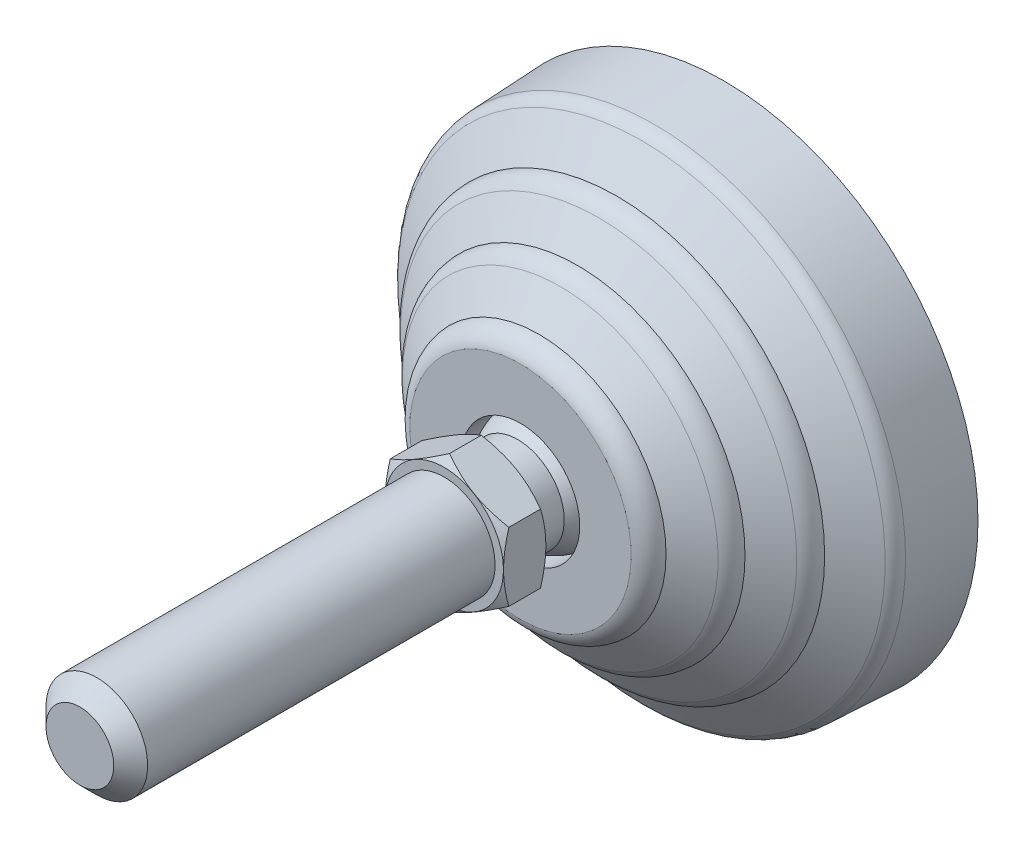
ISO-10303-21;
HEADER;
FILE_DESCRIPTION(('STEP AP214'),'2;1');
FILE_NAME('part.step','',(''),(''),'','','');
FILE_SCHEMA(('AUTOMOTIVE_DESIGN { 1 0 10303 214 1 1 1 1 }'));
ENDSEC;
DATA;
#1=APPLICATION_CONTEXT('core data for automotive mechanical design processes');
#2=APPLICATION_PROTOCOL_DEFINITION('international standard','automotive_design',2000,#1);
#3=PRODUCT_CONTEXT('',#1,'mechanical');
#4=PRODUCT('Part','Part','',(#3));
#5=PRODUCT_RELATED_PRODUCT_CATEGORY('part','',(#4));
#6=PRODUCT_DEFINITION_FORMATION('','',#4);
#7=PRODUCT_DEFINITION_CONTEXT('part definition',#1,'design');
#8=PRODUCT_DEFINITION('design','',#6,#7);
#9=PRODUCT_DEFINITION_SHAPE('','',#8);
#10=(LENGTH_UNIT() NAMED_UNIT(*) SI_UNIT(.MILLI.,.METRE.));
#11=(NAMED_UNIT(*) PLANE_ANGLE_UNIT() SI_UNIT($,.RADIAN.));
#12=(NAMED_UNIT(*) SI_UNIT($,.STERADIAN.) SOLID_ANGLE_UNIT());
#13=UNCERTAINTY_MEASURE_WITH_UNIT(LENGTH_MEASURE(1.E-05),#10,'distance_accuracy_value','');
#14=(GEOMETRIC_REPRESENTATION_CONTEXT(3) GLOBAL_UNCERTAINTY_ASSIGNED_CONTEXT((#13)) GLOBAL_UNIT_ASSIGNED_CONTEXT((#10,
#11,#12)) REPRESENTATION_CONTEXT('',''));
#15=CARTESIAN_POINT('',(0.,0.,0.));
#16=DIRECTION('',(0.,0.,1.));
#17=DIRECTION('',(1.,0.,0.));
#18=AXIS2_PLACEMENT_3D('',#15,#16,#17);
#19=CARTESIAN_POINT('',(0.,0.,53.4265));
#20=DIRECTION('',(0.,0.,-1.));
#21=DIRECTION('',(0.,-1.,0.));
#22=AXIS2_PLACEMENT_3D('',#19,#20,#21);
#23=CYLINDRICAL_SURFACE('',#22,6.);
#24=CARTESIAN_POINT('',(0.,0.,74.));
#25=DIRECTION('',(0.,0.,1.));
#26=DIRECTION('',(0.,-1.,0.));
#27=AXIS2_PLACEMENT_3D('',#24,#25,#26);
#28=CIRCLE('',#27,6.);
#29=CARTESIAN_POINT('',(0.,-6.,74.));
#30=VERTEX_POINT('',#29);
#31=EDGE_CURVE('E9',#30,#30,#28,.F.);
#32=ORIENTED_EDGE('',*,*,#31,.T.);
#33=EDGE_LOOP('',(#32));
#34=FACE_BOUND('',#33,.T.);
#35=CARTESIAN_POINT('',(0.,0.,33.));
#36=DIRECTION('',(0.,0.,-1.));
#37=DIRECTION('',(0.,-1.,0.));
#38=AXIS2_PLACEMENT_3D('',#35,#36,#37);
#39=CIRCLE('',#38,6.);
#40=CARTESIAN_POINT('',(0.,-6.,33.));
#41=VERTEX_POINT('',#40);
#42=EDGE_CURVE('E124',#41,#41,#39,.F.);
#43=ORIENTED_EDGE('',*,*,#42,.T.);
#44=EDGE_LOOP('',(#43));
#45=FACE_BOUND('',#44,.T.);
#46=ADVANCED_FACE('F14',(#34,#45),#23,.T.);
#47=CARTESIAN_POINT('',(-6.495,0.,33.));
#48=DIRECTION('',(0.,0.,1.));
#49=DIRECTION('',(0.,1.,0.));
#50=AXIS2_PLACEMENT_3D('',#47,#48,#49);
#51=PLANE('',#50);
#52=CARTESIAN_POINT('',(0.,0.,33.));
#53=DIRECTION('',(0.,0.,-1.));
#54=DIRECTION('',(0.,-1.,0.));
#55=AXIS2_PLACEMENT_3D('',#52,#53,#54);
#56=CIRCLE('',#55,6.99);
#57=CARTESIAN_POINT('',(0.,-6.99,33.));
#58=VERTEX_POINT('',#57);
#59=EDGE_CURVE('E132',#58,#58,#56,.F.);
#60=ORIENTED_EDGE('',*,*,#59,.T.);
#61=EDGE_LOOP('',(#60));
#62=FACE_BOUND('',#61,.T.);
#63=ORIENTED_EDGE('',*,*,#42,.F.);
#64=EDGE_LOOP('',(#63));
#65=FACE_BOUND('',#64,.T.);
#66=ADVANCED_FACE('F157',(#62,#65),#51,.T.);
#67=CARTESIAN_POINT('',(0.,0.,32.3652257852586));
#68=DIRECTION('',(0.,0.,-1.));
#69=DIRECTION('',(0.,-1.,0.));
#70=AXIS2_PLACEMENT_3D('',#67,#68,#69);
#71=CONICAL_SURFACE('',#70,8.08946119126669,1.0471975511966);
#72=ORIENTED_EDGE('',*,*,#59,.F.);
#73=EDGE_LOOP('',(#72));
#74=FACE_BOUND('',#73,.T.);
#75=CARTESIAN_POINT('',(2.884812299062E-08,8.08290378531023,32.3690117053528));
#76=CARTESIAN_POINT('',(-0.153866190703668,7.99406908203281,32.4202905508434));
#77=CARTESIAN_POINT('',(-0.308306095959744,7.9049031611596,32.4692419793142));
#78=CARTESIAN_POINT('',(-0.618440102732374,7.72584720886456,32.5618490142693));
#79=CARTESIAN_POINT('',(-0.774134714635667,7.63595688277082,32.6055023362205));
#80=CARTESIAN_POINT('',(-1.24371124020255,7.36484674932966,32.7276582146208));
#81=CARTESIAN_POINT('',(-1.55944667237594,7.18255681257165,32.79713799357));
#82=CARTESIAN_POINT('',(-2.03193896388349,6.90976326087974,32.8786092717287));
#83=CARTESIAN_POINT('',(-2.18728420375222,6.8200746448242,32.9018176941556));
#84=CARTESIAN_POINT('',(-2.49867650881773,6.64029221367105,32.9407338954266));
#85=CARTESIAN_POINT('',(-2.65472351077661,6.55019843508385,32.9564423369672));
#86=CARTESIAN_POINT('',(-2.96708844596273,6.36985445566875,32.9799582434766));
#87=CARTESIAN_POINT('',(-3.12340586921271,6.27960454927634,32.9877746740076));
#88=CARTESIAN_POINT('',(-3.43617637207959,6.09902641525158,32.9953473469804));
#89=CARTESIAN_POINT('',(-3.59262944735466,6.00869819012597,32.9951038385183));
#90=CARTESIAN_POINT('',(-4.02123299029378,5.76124381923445,32.9833586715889));
#91=CARTESIAN_POINT('',(-4.29324307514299,5.60419872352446,32.9636515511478));
#92=CARTESIAN_POINT('',(-4.8354566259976,5.29115158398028,32.9011668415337));
#93=CARTESIAN_POINT('',(-5.10565818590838,5.13515064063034,32.8583679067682));
#94=CARTESIAN_POINT('',(-5.64896244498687,4.82147378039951,32.7513856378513));
#95=CARTESIAN_POINT('',(-5.92199660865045,4.66383743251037,32.6867491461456));
#96=CARTESIAN_POINT('',(-6.46399382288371,4.35091519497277,32.5400514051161));
#97=CARTESIAN_POINT('',(-6.73296381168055,4.19562529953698,32.4580246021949));
#98=CARTESIAN_POINT('',(-6.99999992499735,4.04145192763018,32.3690117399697));
#99=B_SPLINE_CURVE_WITH_KNOTS('',3,(#75,#76,#77,#78,#79,#80,#81,#82,#83,#84,#85,#86,#87,#88,#89,
#90,#91,#92,#93,#94,#95,#96,#97,#98),.UNSPECIFIED.,.F.,.F.,(4,2,2,2,2,2,2,2,2,2,2,4),(0.,
0.554720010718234,1.1096783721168,2.22190069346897,2.76439121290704,3.30683378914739,
3.84865943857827,4.39046834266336,5.33360245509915,6.27760987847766,7.24255086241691,
8.20559807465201),.UNSPECIFIED.);
#100=CARTESIAN_POINT('',(1.44240629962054E-08,8.0829037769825,32.3690117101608));
#101=VERTEX_POINT('',#100);
#102=CARTESIAN_POINT('',(-7.,4.04145190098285,32.3690117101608));
#103=VERTEX_POINT('',#102);
#104=EDGE_CURVE('E143',#101,#103,#99,.T.);
#105=ORIENTED_EDGE('',*,*,#104,.T.);
#106=CARTESIAN_POINT('',(-7.,4.04145191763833,32.3690117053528));
#107=CARTESIAN_POINT('',(-7.,3.70968878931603,32.4647934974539));
#108=CARTESIAN_POINT('',(-7.,3.37530112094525,32.5524844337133));
#109=CARTESIAN_POINT('',(-7.,2.70109388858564,32.7074672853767));
#110=CARTESIAN_POINT('',(-7.,2.36126392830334,32.7747135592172));
#111=CARTESIAN_POINT('',(-7.,1.68541720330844,32.882853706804));
#112=CARTESIAN_POINT('',(-7.,1.34949559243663,32.9243241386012));
#113=CARTESIAN_POINT('',(-7.,0.675714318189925,32.9799957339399));
#114=CARTESIAN_POINT('',(-7.,0.3378571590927,32.9942264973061));
#115=CARTESIAN_POINT('',(-7.,-0.337857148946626,32.9942264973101));
#116=CARTESIAN_POINT('',(-7.,-0.675714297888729,32.9799957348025));
#117=CARTESIAN_POINT('',(-7.,-1.34949555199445,32.9243241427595));
#118=CARTESIAN_POINT('',(-7.,-1.68541715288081,32.8828537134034));
#119=CARTESIAN_POINT('',(-7.,-2.36126385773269,32.7747135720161));
#120=CARTESIAN_POINT('',(-7.,-2.70109380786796,32.7074673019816));
#121=CARTESIAN_POINT('',(-7.,-3.37530102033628,32.5524844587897));
#122=CARTESIAN_POINT('',(-7.,-3.70968867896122,32.4647935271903));
#123=CARTESIAN_POINT('',(-7.,-4.04145179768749,32.3690117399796));
#124=B_SPLINE_CURVE_WITH_KNOTS('',3,(#106,#107,#108,#109,#110,#111,#112,#113,#114,#115,#116,
#117,#118,#119,#120,#121,#122,#123),.UNSPECIFIED.,.F.,.F.,(4,2,2,2,2,2,2,2,4),(0.,
1.03625689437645,2.07481046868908,3.08920803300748,4.10250268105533,5.11579729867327,
6.13019483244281,7.16874837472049,8.20500523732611),.UNSPECIFIED.);
#125=CARTESIAN_POINT('',(-7.00000001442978,-4.04145187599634,32.3690117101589));
#126=VERTEX_POINT('',#125);
#127=EDGE_CURVE('E135',#103,#126,#124,.T.);
#128=ORIENTED_EDGE('',*,*,#127,.T.);
#129=CARTESIAN_POINT('',(-7.00000002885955,-4.04145186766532,32.3690117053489));
#130=CARTESIAN_POINT('',(-6.84613380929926,-4.13028657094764,32.4202905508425));
#131=CARTESIAN_POINT('',(-6.69169390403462,-4.2194524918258,32.4692419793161));
#132=CARTESIAN_POINT('',(-6.3815598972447,-4.39850844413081,32.5618490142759));
#133=CARTESIAN_POINT('',(-6.2258652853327,-4.48839877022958,32.6055023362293));
#134=CARTESIAN_POINT('',(-5.75628875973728,-4.75950890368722,32.7276582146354));
#135=CARTESIAN_POINT('',(-5.44055332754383,-4.94179884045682,32.797137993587));
#136=CARTESIAN_POINT('',(-4.96806103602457,-5.21459239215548,32.8786092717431));
#137=CARTESIAN_POINT('',(-4.81271579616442,-5.30428100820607,32.9018176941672));
#138=CARTESIAN_POINT('',(-4.50132349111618,-5.48406343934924,32.9407338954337));
#139=CARTESIAN_POINT('',(-4.345276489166,-5.57415721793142,32.9564423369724));
#140=CARTESIAN_POINT('',(-4.0329115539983,-5.75450119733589,32.9799582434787));
#141=CARTESIAN_POINT('',(-3.87659413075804,-5.84475110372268,32.9877746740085));
#142=CARTESIAN_POINT('',(-3.56382362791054,-6.02532923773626,32.9953473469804));
#143=CARTESIAN_POINT('',(-3.40737055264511,-6.1156574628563,32.9951038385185));
#144=CARTESIAN_POINT('',(-2.97876700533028,-6.36311183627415,32.9833586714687));
#145=CARTESIAN_POINT('',(-2.70675691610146,-6.5201569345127,32.9636515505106));
#146=CARTESIAN_POINT('',(-2.16454335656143,-6.8332040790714,32.9011668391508));
#147=CARTESIAN_POINT('',(-1.89434179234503,-6.9892050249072,32.8583679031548));
#148=CARTESIAN_POINT('',(-1.35103752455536,-7.30288189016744,32.7513856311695));
#149=CARTESIAN_POINT('',(-1.07800335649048,-7.46051824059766,32.6867491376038));
#150=CARTESIAN_POINT('',(-0.536006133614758,-7.77344048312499,32.5400513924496));
#151=CARTESIAN_POINT('',(-0.267036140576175,-7.92873038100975,32.4580245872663));
#152=CARTESIAN_POINT('',(-2.30772582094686E-08,-8.0829037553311,32.3690117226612));
#153=B_SPLINE_CURVE_WITH_KNOTS('',3,(#129,#130,#131,#132,#133,#134,#135,#136,#137,#138,#139,
#140,#141,#142,#143,#144,#145,#146,#147,#148,#149,#150,#151,#152),.UNSPECIFIED.,.F.,.F.,(4,2,2,
2,2,2,2,2,2,2,2,4),(0.,0.554720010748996,1.10967837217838,2.22190069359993,2.7643912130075,
3.30683378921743,3.84865943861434,4.3904683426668,5.33360247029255,6.2776099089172,
7.24255090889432,8.20559813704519),.UNSPECIFIED.);
#154=CARTESIAN_POINT('',(1.15386261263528E-08,-8.08290376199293,32.369011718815));
#155=VERTEX_POINT('',#154);
#156=EDGE_CURVE('E181',#126,#155,#153,.T.);
#157=ORIENTED_EDGE('',*,*,#156,.T.);
#158=CARTESIAN_POINT('',(2.30772558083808E-08,-8.0829037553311,32.3690117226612));
#159=CARTESIAN_POINT('',(0.153866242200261,-7.99406905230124,32.4202905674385));
#160=CARTESIAN_POINT('',(0.308306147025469,-7.90490313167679,32.4692419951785));
#161=CARTESIAN_POINT('',(0.618440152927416,-7.72584717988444,32.5618490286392));
#162=CARTESIAN_POINT('',(0.77413476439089,-7.63595685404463,32.6055023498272));
#163=CARTESIAN_POINT('',(1.24371128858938,-7.3648467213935,32.7276582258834));
#164=CARTESIAN_POINT('',(1.55944671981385,-7.18255678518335,32.7971380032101));
#165=CARTESIAN_POINT('',(2.03193900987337,-6.90976323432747,32.878609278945));
#166=CARTESIAN_POINT('',(2.18728424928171,-6.82007461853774,32.9018177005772));
#167=CARTESIAN_POINT('',(2.49867655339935,-6.64029218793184,32.9407339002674));
#168=CARTESIAN_POINT('',(2.65472355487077,-6.55019840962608,32.9564423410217));
#169=CARTESIAN_POINT('',(2.96708848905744,-6.369854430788,32.9799582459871));
#170=CARTESIAN_POINT('',(3.12340591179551,-6.27960452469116,32.98777467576));
#171=CARTESIAN_POINT('',(3.43617641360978,-6.09902639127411,32.9953473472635));
#172=CARTESIAN_POINT('',(3.59262948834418,-6.00869816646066,32.99510383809));
#173=CARTESIAN_POINT('',(4.02123302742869,-5.76124379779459,32.9833586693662));
#174=CARTESIAN_POINT('',(4.29324310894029,-5.60419870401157,32.9636515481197));
#175=CARTESIAN_POINT('',(4.83545665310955,-5.2911515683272,32.9011668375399));
#176=CARTESIAN_POINT('',(5.10565820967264,-5.13515062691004,32.8583679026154));
#177=CARTESIAN_POINT('',(5.64896246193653,-4.82147377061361,32.7513856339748));
#178=CARTESIAN_POINT('',(5.92199662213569,-4.66383742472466,32.6867491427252));
#179=CARTESIAN_POINT('',(6.46399382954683,-4.35091519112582,32.5400514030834));
#180=CARTESIAN_POINT('',(6.73296381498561,-4.19562529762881,32.4580246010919));
#181=CARTESIAN_POINT('',(6.99999992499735,-4.04145192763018,32.3690117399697));
#182=B_SPLINE_CURVE_WITH_KNOTS('',3,(#158,#159,#160,#161,#162,#163,#164,#165,#166,#167,#168,
#169,#170,#171,#172,#173,#174,#175,#176,#177,#178,#179,#180,#181),.UNSPECIFIED.,.F.,.F.,(4,2,2,
2,2,2,2,2,2,2,2,4),(0.,0.554720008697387,1.10967836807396,2.22190068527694,2.76439120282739,
3.30683377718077,3.8486594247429,4.39046832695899,5.33360242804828,6.27760984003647,
7.24255081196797,8.20559801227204),.UNSPECIFIED.);
#183=CARTESIAN_POINT('',(7.,-4.04145190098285,32.3690117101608));
#184=VERTEX_POINT('',#183);
#185=EDGE_CURVE('E173',#155,#184,#182,.T.);
#186=ORIENTED_EDGE('',*,*,#185,.T.);
#187=CARTESIAN_POINT('',(7.,-4.04145191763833,32.3690117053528));
#188=CARTESIAN_POINT('',(7.,-3.70968878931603,32.4647934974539));
#189=CARTESIAN_POINT('',(7.,-3.37530112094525,32.5524844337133));
#190=CARTESIAN_POINT('',(7.,-2.70109388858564,32.7074672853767));
#191=CARTESIAN_POINT('',(7.,-2.36126392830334,32.7747135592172));
#192=CARTESIAN_POINT('',(7.,-1.68541720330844,32.882853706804));
#193=CARTESIAN_POINT('',(7.,-1.34949559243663,32.9243241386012));
#194=CARTESIAN_POINT('',(7.,-0.675714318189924,32.9799957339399));
#195=CARTESIAN_POINT('',(7.,-0.3378571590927,32.9942264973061));
#196=CARTESIAN_POINT('',(7.,0.337857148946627,32.9942264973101));
#197=CARTESIAN_POINT('',(7.,0.675714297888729,32.9799957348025));
#198=CARTESIAN_POINT('',(7.,1.34949555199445,32.9243241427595));
#199=CARTESIAN_POINT('',(7.,1.68541715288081,32.8828537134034));
#200=CARTESIAN_POINT('',(7.,2.36126385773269,32.7747135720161));
#201=CARTESIAN_POINT('',(7.,2.70109380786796,32.7074673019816));
#202=CARTESIAN_POINT('',(7.,3.37530102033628,32.5524844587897));
#203=CARTESIAN_POINT('',(7.,3.70968867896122,32.4647935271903));
#204=CARTESIAN_POINT('',(7.,4.04145179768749,32.3690117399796));
#205=B_SPLINE_CURVE_WITH_KNOTS('',3,(#187,#188,#189,#190,#191,#192,#193,#194,#195,#196,#197,
#198,#199,#200,#201,#202,#203,#204),.UNSPECIFIED.,.F.,.F.,(4,2,2,2,2,2,2,2,4),(0.,
1.03625689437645,2.07481046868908,3.08920803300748,4.10250268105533,5.11579729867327,
6.13019483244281,7.16874837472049,8.20500523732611),.UNSPECIFIED.);
#206=CARTESIAN_POINT('',(7.00000001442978,4.04145187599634,32.3690117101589));
#207=VERTEX_POINT('',#206);
#208=EDGE_CURVE('E342',#184,#207,#205,.T.);
#209=ORIENTED_EDGE('',*,*,#208,.T.);
#210=CARTESIAN_POINT('',(7.00000002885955,4.04145186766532,32.3690117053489));
#211=CARTESIAN_POINT('',(6.84613380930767,4.13028657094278,32.4202905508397));
#212=CARTESIAN_POINT('',(6.6916939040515,4.21945249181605,32.4692419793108));
#213=CARTESIAN_POINT('',(6.38155989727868,4.39850844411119,32.5618490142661));
#214=CARTESIAN_POINT('',(6.22586528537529,4.48839877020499,32.6055023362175));
#215=CARTESIAN_POINT('',(5.7562887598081,4.75950890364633,32.7276582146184));
#216=CARTESIAN_POINT('',(5.4405533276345,4.94179884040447,32.7971379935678));
#217=CARTESIAN_POINT('',(4.96806103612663,5.21459239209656,32.8786092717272));
#218=CARTESIAN_POINT('',(4.81271579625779,5.30428100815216,32.9018176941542));
#219=CARTESIAN_POINT('',(4.50132349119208,5.48406343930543,32.9407338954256));
#220=CARTESIAN_POINT('',(4.34527648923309,5.57415721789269,32.9564423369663));
#221=CARTESIAN_POINT('',(4.03291155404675,5.75450119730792,32.9799582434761));
#222=CARTESIAN_POINT('',(3.87659413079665,5.84475110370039,32.9877746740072));
#223=CARTESIAN_POINT('',(3.56382362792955,6.02532923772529,32.9953473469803));
#224=CARTESIAN_POINT('',(3.40737055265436,6.11565746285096,32.9951038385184));
#225=CARTESIAN_POINT('',(2.97876700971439,6.36311183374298,32.9833586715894));
#226=CARTESIAN_POINT('',(2.70675692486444,6.52015692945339,32.9636515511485));
#227=CARTESIAN_POINT('',(2.16454337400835,6.83320406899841,32.9011668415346));
#228=CARTESIAN_POINT('',(1.89434181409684,6.98920501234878,32.8583679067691));
#229=CARTESIAN_POINT('',(1.35103755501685,7.30288187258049,32.7513856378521));
#230=CARTESIAN_POINT('',(1.07800339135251,7.46051822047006,32.6867491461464));
#231=CARTESIAN_POINT('',(0.536006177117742,7.77344045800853,32.5400514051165));
#232=CARTESIAN_POINT('',(0.267036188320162,7.92873035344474,32.4580246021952));
#233=CARTESIAN_POINT('',(7.50026377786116E-08,8.08290372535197,32.3690117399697));
#234=B_SPLINE_CURVE_WITH_KNOTS('',3,(#210,#211,#212,#213,#214,#215,#216,#217,#218,#219,#220,
#221,#222,#223,#224,#225,#226,#227,#228,#229,#230,#231,#232,#233),.UNSPECIFIED.,.F.,.F.,(4,2,2,
2,2,2,2,2,2,2,2,4),(0.,0.554720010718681,1.1096783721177,2.22190069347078,2.76439121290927,
3.30683378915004,3.84865943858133,4.39046834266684,5.33360245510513,6.27760987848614,
7.24255086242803,8.20559807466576),.UNSPECIFIED.);
#235=EDGE_CURVE('E163',#207,#101,#234,.T.);
#236=ORIENTED_EDGE('',*,*,#235,.T.);
#237=EDGE_LOOP('',(#105,#128,#157,#186,#209,#236));
#238=FACE_BOUND('',#237,.T.);
#239=ADVANCED_FACE('F152',(#74,#238),#71,.T.);
#240=CARTESIAN_POINT('',(0.,8.08290376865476,33.1));
#241=DIRECTION('',(-0.5,-0.866025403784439,0.));
#242=DIRECTION('',(0.866025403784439,-0.5,0.));
#243=AXIS2_PLACEMENT_3D('',#240,#241,#242);
#244=PLANE('',#243);
#245=DIRECTION('',(0.,0.,1.));
#246=VECTOR('',#245,1.);
#247=CARTESIAN_POINT('',(0.,8.08290376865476,33.1));
#248=LINE('',#247,#246);
#249=CARTESIAN_POINT('',(0.,8.08290376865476,28.6309882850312));
#250=VERTEX_POINT('',#249);
#251=EDGE_CURVE('E368',#250,#101,#248,.T.);
#252=ORIENTED_EDGE('',*,*,#251,.T.);
#253=ORIENTED_EDGE('',*,*,#235,.F.);
#254=DIRECTION('',(0.,0.,1.));
#255=VECTOR('',#254,1.);
#256=CARTESIAN_POINT('',(7.,4.04145188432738,33.1));
#257=LINE('',#256,#255);
#258=CARTESIAN_POINT('',(7.,4.04145188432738,28.6309882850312));
#259=VERTEX_POINT('',#258);
#260=EDGE_CURVE('E360',#259,#207,#257,.T.);
#261=ORIENTED_EDGE('',*,*,#260,.F.);
#262=CARTESIAN_POINT('',(0.,8.08290376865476,28.6309882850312));
#263=CARTESIAN_POINT('',(0.153866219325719,7.99406906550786,28.5797094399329));
#264=CARTESIAN_POINT('',(0.308306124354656,7.90490314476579,28.5307580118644));
#265=CARTESIAN_POINT('',(0.618440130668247,7.72584719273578,28.4381509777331));
#266=CARTESIAN_POINT('',(0.774134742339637,7.63595686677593,28.3944976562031));
#267=CARTESIAN_POINT('',(1.24371126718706,7.36484673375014,28.2723417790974));
#268=CARTESIAN_POINT('',(1.55944669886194,7.18255679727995,28.2028620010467));
#269=CARTESIAN_POINT('',(2.03193898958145,6.90976324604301,28.1213907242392));
#270=CARTESIAN_POINT('',(2.18728422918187,6.82007463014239,28.098182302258));
#271=CARTESIAN_POINT('',(2.49867653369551,6.64029219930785,28.0592661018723));
#272=CARTESIAN_POINT('',(2.65472353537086,6.55019842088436,28.0435576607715));
#273=CARTESIAN_POINT('',(2.96708846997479,6.36985444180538,28.0200417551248));
#274=CARTESIAN_POINT('',(3.12340589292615,6.27960453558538,28.012225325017));
#275=CARTESIAN_POINT('',(3.43617639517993,6.09902640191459,28.0046526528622));
#276=CARTESIAN_POINT('',(3.59262947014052,6.00869817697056,28.0048961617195));
#277=CARTESIAN_POINT('',(4.02123301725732,5.76124380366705,28.0166413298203));
#278=CARTESIAN_POINT('',(4.29324310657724,5.60419870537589,28.0363484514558));
#279=CARTESIAN_POINT('',(4.83545666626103,5.29115156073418,28.0988331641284));
#280=CARTESIAN_POINT('',(5.10565823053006,5.135150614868,28.1416321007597));
#281=CARTESIAN_POINT('',(5.64896249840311,4.82147374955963,28.248614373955));
#282=CARTESIAN_POINT('',(5.92199666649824,4.66383739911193,28.3132508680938));
#283=CARTESIAN_POINT('',(6.46399388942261,4.35091515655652,28.4599486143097));
#284=CARTESIAN_POINT('',(6.73296388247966,4.1956252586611,28.5419754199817));
#285=CARTESIAN_POINT('',(7.,4.04145188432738,28.6309882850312));
#286=B_SPLINE_CURVE_WITH_KNOTS('',3,(#262,#263,#264,#265,#266,#267,#268,#269,#270,#271,#272,
#273,#274,#275,#276,#277,#278,#279,#280,#281,#282,#283,#284,#285),.UNSPECIFIED.,.F.,.F.,(4,2,2,
2,2,2,2,2,2,2,2,4),(0.,0.5547200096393,1.10967836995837,2.22190068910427,2.76439120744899,
3.30683378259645,3.84865943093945,4.39046833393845,5.33360246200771,6.2776099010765,
7.24255090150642,8.20559813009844),.UNSPECIFIED.);
#287=EDGE_CURVE('E362',#250,#259,#286,.T.);
#288=ORIENTED_EDGE('',*,*,#287,.F.);
#289=EDGE_LOOP('',(#252,#253,#261,#288));
#290=FACE_BOUND('',#289,.T.);
#291=ADVANCED_FACE('F156',(#290),#244,.F.);
#292=CARTESIAN_POINT('',(-7.,4.04145188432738,33.1));
#293=DIRECTION('',(0.5,-0.866025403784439,0.));
#294=DIRECTION('',(0.866025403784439,0.5,0.));
#295=AXIS2_PLACEMENT_3D('',#292,#293,#294);
#296=PLANE('',#295);
#297=DIRECTION('',(0.,0.,1.));
#298=VECTOR('',#297,1.);
#299=CARTESIAN_POINT('',(-7.,4.04145188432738,33.1));
#300=LINE('',#299,#298);
#301=CARTESIAN_POINT('',(-7.,4.04145188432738,28.6309882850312));
#302=VERTEX_POINT('',#301);
#303=EDGE_CURVE('E31',#302,#103,#300,.T.);
#304=ORIENTED_EDGE('',*,*,#303,.T.);
#305=ORIENTED_EDGE('',*,*,#104,.F.);
#306=ORIENTED_EDGE('',*,*,#251,.F.);
#307=CARTESIAN_POINT('',(-7.,4.04145188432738,28.6309882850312));
#308=CARTESIAN_POINT('',(-6.84613378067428,4.13028658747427,28.5797094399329));
#309=CARTESIAN_POINT('',(-6.69169387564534,4.21945250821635,28.5307580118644));
#310=CARTESIAN_POINT('',(-6.38155986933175,4.39850846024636,28.4381509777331));
#311=CARTESIAN_POINT('',(-6.22586525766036,4.48839878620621,28.3944976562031));
#312=CARTESIAN_POINT('',(-5.75628873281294,4.759508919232,28.2723417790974));
#313=CARTESIAN_POINT('',(-5.44055330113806,4.94179885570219,28.2028620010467));
#314=CARTESIAN_POINT('',(-4.96806101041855,5.21459240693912,28.1213907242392));
#315=CARTESIAN_POINT('',(-4.81271577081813,5.30428102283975,28.098182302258));
#316=CARTESIAN_POINT('',(-4.50132346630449,5.48406345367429,28.0592661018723));
#317=CARTESIAN_POINT('',(-4.34527646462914,5.57415723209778,28.0435576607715));
#318=CARTESIAN_POINT('',(-4.0329115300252,5.75450121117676,28.0200417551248));
#319=CARTESIAN_POINT('',(-3.87659410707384,5.84475111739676,28.012225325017));
#320=CARTESIAN_POINT('',(-3.56382360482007,6.02532925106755,28.0046526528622));
#321=CARTESIAN_POINT('',(-3.40737052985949,6.11565747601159,28.0048961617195));
#322=CARTESIAN_POINT('',(-2.97876698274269,6.36311184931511,28.0166413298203));
#323=CARTESIAN_POINT('',(-2.70675689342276,6.52015694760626,28.0363484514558));
#324=CARTESIAN_POINT('',(-2.16454333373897,6.83320409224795,28.0988331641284));
#325=CARTESIAN_POINT('',(-1.89434176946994,6.98920503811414,28.1416321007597));
#326=CARTESIAN_POINT('',(-1.35103750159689,7.30288190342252,28.248614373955));
#327=CARTESIAN_POINT('',(-1.07800333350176,7.4605182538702,28.3132508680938));
#328=CARTESIAN_POINT('',(-0.536006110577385,7.77344049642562,28.4599486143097));
#329=CARTESIAN_POINT('',(-0.267036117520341,7.92873039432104,28.5419754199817));
#330=CARTESIAN_POINT('',(0.,8.08290376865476,28.6309882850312));
#331=B_SPLINE_CURVE_WITH_KNOTS('',3,(#307,#308,#309,#310,#311,#312,#313,#314,#315,#316,#317,
#318,#319,#320,#321,#322,#323,#324,#325,#326,#327,#328,#329,#330),.UNSPECIFIED.,.F.,.F.,(4,2,2,
2,2,2,2,2,2,2,2,4),(0.,0.5547200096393,1.10967836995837,2.22190068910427,2.76439120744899,
3.30683378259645,3.84865943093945,4.39046833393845,5.33360246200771,6.2776099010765,
7.24255090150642,8.20559813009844),.UNSPECIFIED.);
#332=EDGE_CURVE('E369',#302,#250,#331,.T.);
#333=ORIENTED_EDGE('',*,*,#332,.F.);
#334=EDGE_LOOP('',(#304,#305,#306,#333));
#335=FACE_BOUND('',#334,.T.);
#336=ADVANCED_FACE('F375',(#335),#296,.F.);
#337=CARTESIAN_POINT('',(7.,-4.04145188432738,33.1));
#338=DIRECTION('',(-0.5,0.866025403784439,0.));
#339=DIRECTION('',(-0.866025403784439,-0.5,0.));
#340=AXIS2_PLACEMENT_3D('',#337,#338,#339);
#341=PLANE('',#340);
#342=DIRECTION('',(0.,0.,1.));
#343=VECTOR('',#342,1.);
#344=CARTESIAN_POINT('',(7.,-4.04145188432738,33.1));
#345=LINE('',#344,#343);
#346=CARTESIAN_POINT('',(7.,-4.04145188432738,28.6309882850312));
#347=VERTEX_POINT('',#346);
#348=EDGE_CURVE('E361',#347,#184,#345,.T.);
#349=ORIENTED_EDGE('',*,*,#348,.T.);
#350=ORIENTED_EDGE('',*,*,#185,.F.);
#351=DIRECTION('',(0.,0.,1.));
#352=VECTOR('',#351,1.);
#353=CARTESIAN_POINT('',(0.,-8.08290376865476,33.1));
#354=LINE('',#353,#352);
#355=CARTESIAN_POINT('',(0.,-8.08290376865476,28.6309882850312));
#356=VERTEX_POINT('',#355);
#357=EDGE_CURVE('E212',#356,#155,#354,.T.);
#358=ORIENTED_EDGE('',*,*,#357,.F.);
#359=CARTESIAN_POINT('',(7.,-4.04145188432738,28.6309882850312));
#360=CARTESIAN_POINT('',(6.84613378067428,-4.13028658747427,28.5797094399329));
#361=CARTESIAN_POINT('',(6.69169387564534,-4.21945250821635,28.5307580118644));
#362=CARTESIAN_POINT('',(6.38155986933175,-4.39850846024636,28.4381509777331));
#363=CARTESIAN_POINT('',(6.22586525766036,-4.48839878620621,28.3944976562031));
#364=CARTESIAN_POINT('',(5.75628873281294,-4.759508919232,28.2723417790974));
#365=CARTESIAN_POINT('',(5.44055330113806,-4.94179885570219,28.2028620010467));
#366=CARTESIAN_POINT('',(4.96806101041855,-5.21459240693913,28.1213907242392));
#367=CARTESIAN_POINT('',(4.81271577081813,-5.30428102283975,28.098182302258));
#368=CARTESIAN_POINT('',(4.50132346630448,-5.48406345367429,28.0592661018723));
#369=CARTESIAN_POINT('',(4.34527646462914,-5.57415723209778,28.0435576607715));
#370=CARTESIAN_POINT('',(4.0329115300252,-5.75450121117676,28.0200417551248));
#371=CARTESIAN_POINT('',(3.87659410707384,-5.84475111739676,28.0122253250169));
#372=CARTESIAN_POINT('',(3.56382360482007,-6.02532925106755,28.0046526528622));
#373=CARTESIAN_POINT('',(3.40737052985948,-6.11565747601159,28.0048961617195));
#374=CARTESIAN_POINT('',(2.97876698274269,-6.36311184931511,28.0166413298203));
#375=CARTESIAN_POINT('',(2.70675689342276,-6.52015694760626,28.0363484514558));
#376=CARTESIAN_POINT('',(2.16454333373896,-6.83320409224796,28.0988331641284));
#377=CARTESIAN_POINT('',(1.89434176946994,-6.98920503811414,28.1416321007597));
#378=CARTESIAN_POINT('',(1.35103750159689,-7.30288190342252,28.248614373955));
#379=CARTESIAN_POINT('',(1.07800333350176,-7.46051825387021,28.3132508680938));
#380=CARTESIAN_POINT('',(0.536006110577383,-7.77344049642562,28.4599486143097));
#381=CARTESIAN_POINT('',(0.267036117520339,-7.92873039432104,28.5419754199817));
#382=CARTESIAN_POINT('',(0.,-8.08290376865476,28.6309882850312));
#383=B_SPLINE_CURVE_WITH_KNOTS('',3,(#359,#360,#361,#362,#363,#364,#365,#366,#367,#368,#369,
#370,#371,#372,#373,#374,#375,#376,#377,#378,#379,#380,#381,#382),.UNSPECIFIED.,.F.,.F.,(4,2,2,
2,2,2,2,2,2,2,2,4),(0.,0.554720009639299,1.10967836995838,2.22190068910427,2.76439120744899,
3.30683378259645,3.84865943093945,4.39046833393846,5.33360246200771,6.27760990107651,
7.24255090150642,8.20559813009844),.UNSPECIFIED.);
#384=EDGE_CURVE('E214',#347,#356,#383,.T.);
#385=ORIENTED_EDGE('',*,*,#384,.F.);
#386=EDGE_LOOP('',(#349,#350,#358,#385));
#387=FACE_BOUND('',#386,.T.);
#388=ADVANCED_FACE('F200',(#387),#341,.F.);
#389=CARTESIAN_POINT('',(7.,4.04145188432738,33.1));
#390=DIRECTION('',(-1.,0.,0.));
#391=DIRECTION('',(0.,-1.,0.));
#392=AXIS2_PLACEMENT_3D('',#389,#390,#391);
#393=PLANE('',#392);
#394=ORIENTED_EDGE('',*,*,#260,.T.);
#395=ORIENTED_EDGE('',*,*,#208,.F.);
#396=ORIENTED_EDGE('',*,*,#348,.F.);
#397=CARTESIAN_POINT('',(7.,4.04145188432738,28.6309882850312));
#398=CARTESIAN_POINT('',(7.,3.70968875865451,28.5352064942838));
#399=CARTESIAN_POINT('',(7.,3.3753010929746,28.4475155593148));
#400=CARTESIAN_POINT('',(7.,2.7010938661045,28.292532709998));
#401=CARTESIAN_POINT('',(7.,2.36126390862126,28.2252864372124));
#402=CARTESIAN_POINT('',(7.,1.68541718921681,28.1171462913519));
#403=CARTESIAN_POINT('',(7.,1.3494955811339,28.075675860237));
#404=CARTESIAN_POINT('',(7.,0.675714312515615,28.0200042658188));
#405=CARTESIAN_POINT('',(7.,0.337857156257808,28.0057735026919));
#406=CARTESIAN_POINT('',(7.,-0.337857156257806,28.0057735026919));
#407=CARTESIAN_POINT('',(7.,-0.675714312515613,28.0200042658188));
#408=CARTESIAN_POINT('',(7.,-1.3494955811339,28.075675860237));
#409=CARTESIAN_POINT('',(7.,-1.68541718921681,28.1171462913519));
#410=CARTESIAN_POINT('',(7.,-2.36126390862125,28.2252864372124));
#411=CARTESIAN_POINT('',(7.,-2.7010938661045,28.292532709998));
#412=CARTESIAN_POINT('',(7.,-3.3753010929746,28.4475155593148));
#413=CARTESIAN_POINT('',(7.,-3.70968875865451,28.5352064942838));
#414=CARTESIAN_POINT('',(7.,-4.04145188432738,28.6309882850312));
#415=B_SPLINE_CURVE_WITH_KNOTS('',3,(#397,#398,#399,#400,#401,#402,#403,#404,#405,#406,#407,
#408,#409,#410,#411,#412,#413,#414),.UNSPECIFIED.,.F.,.F.,(4,2,2,2,2,2,2,2,4),(0.,
1.03625688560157,2.07481045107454,3.08920800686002,4.10250264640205,5.11579728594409,
6.13019484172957,7.16874840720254,8.20500529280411),.UNSPECIFIED.);
#416=EDGE_CURVE('E354',#259,#347,#415,.T.);
#417=ORIENTED_EDGE('',*,*,#416,.F.);
#418=EDGE_LOOP('',(#394,#395,#396,#417));
#419=FACE_BOUND('',#418,.T.);
#420=ADVANCED_FACE('F348',(#419),#393,.F.);
#421=CARTESIAN_POINT('',(-7.,-4.04145188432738,33.1));
#422=DIRECTION('',(1.,0.,0.));
#423=DIRECTION('',(0.,1.,0.));
#424=AXIS2_PLACEMENT_3D('',#421,#422,#423);
#425=PLANE('',#424);
#426=DIRECTION('',(0.,0.,1.));
#427=VECTOR('',#426,1.);
#428=CARTESIAN_POINT('',(-7.,-4.04145188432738,33.1));
#429=LINE('',#428,#427);
#430=CARTESIAN_POINT('',(-7.,-4.04145188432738,28.6309882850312));
#431=VERTEX_POINT('',#430);
#432=EDGE_CURVE('E402',#126,#431,#429,.F.);
#433=ORIENTED_EDGE('',*,*,#432,.F.);
#434=ORIENTED_EDGE('',*,*,#127,.F.);
#435=ORIENTED_EDGE('',*,*,#303,.F.);
#436=CARTESIAN_POINT('',(-7.,-4.04145188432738,28.6309882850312));
#437=CARTESIAN_POINT('',(-7.,-3.70968875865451,28.5352064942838));
#438=CARTESIAN_POINT('',(-7.,-3.3753010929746,28.4475155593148));
#439=CARTESIAN_POINT('',(-7.,-2.7010938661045,28.292532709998));
#440=CARTESIAN_POINT('',(-7.,-2.36126390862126,28.2252864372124));
#441=CARTESIAN_POINT('',(-7.,-1.68541718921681,28.1171462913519));
#442=CARTESIAN_POINT('',(-7.,-1.3494955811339,28.075675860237));
#443=CARTESIAN_POINT('',(-7.,-0.675714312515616,28.0200042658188));
#444=CARTESIAN_POINT('',(-7.,-0.33785715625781,28.0057735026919));
#445=CARTESIAN_POINT('',(-7.,0.337857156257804,28.0057735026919));
#446=CARTESIAN_POINT('',(-7.,0.675714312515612,28.0200042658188));
#447=CARTESIAN_POINT('',(-7.,1.3494955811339,28.075675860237));
#448=CARTESIAN_POINT('',(-7.,1.68541718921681,28.1171462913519));
#449=CARTESIAN_POINT('',(-7.,2.36126390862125,28.2252864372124));
#450=CARTESIAN_POINT('',(-7.,2.7010938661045,28.292532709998));
#451=CARTESIAN_POINT('',(-7.,3.3753010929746,28.4475155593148));
#452=CARTESIAN_POINT('',(-7.,3.70968875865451,28.5352064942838));
#453=CARTESIAN_POINT('',(-7.,4.04145188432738,28.6309882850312));
#454=B_SPLINE_CURVE_WITH_KNOTS('',3,(#436,#437,#438,#439,#440,#441,#442,#443,#444,#445,#446,
#447,#448,#449,#450,#451,#452,#453),.UNSPECIFIED.,.F.,.F.,(4,2,2,2,2,2,2,2,4),(0.,
1.03625688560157,2.07481045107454,3.08920800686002,4.10250264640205,5.11579728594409,
6.13019484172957,7.16874840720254,8.20500529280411),.UNSPECIFIED.);
#455=EDGE_CURVE('E189',#431,#302,#454,.T.);
#456=ORIENTED_EDGE('',*,*,#455,.F.);
#457=EDGE_LOOP('',(#433,#434,#435,#456));
#458=FACE_BOUND('',#457,.T.);
#459=ADVANCED_FACE('F150',(#458),#425,.F.);
#460=CARTESIAN_POINT('',(0.,-8.08290376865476,33.1));
#461=DIRECTION('',(0.5,0.866025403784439,0.));
#462=DIRECTION('',(-0.866025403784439,0.5,0.));
#463=AXIS2_PLACEMENT_3D('',#460,#461,#462);
#464=PLANE('',#463);
#465=ORIENTED_EDGE('',*,*,#357,.T.);
#466=ORIENTED_EDGE('',*,*,#156,.F.);
#467=ORIENTED_EDGE('',*,*,#432,.T.);
#468=CARTESIAN_POINT('',(0.,-8.08290376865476,28.6309882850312));
#469=CARTESIAN_POINT('',(-0.153866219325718,-7.99406906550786,28.5797094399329));
#470=CARTESIAN_POINT('',(-0.308306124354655,-7.90490314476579,28.5307580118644));
#471=CARTESIAN_POINT('',(-0.618440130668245,-7.72584719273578,28.4381509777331));
#472=CARTESIAN_POINT('',(-0.774134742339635,-7.63595686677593,28.3944976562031));
#473=CARTESIAN_POINT('',(-1.24371126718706,-7.36484673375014,28.2723417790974));
#474=CARTESIAN_POINT('',(-1.55944669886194,-7.18255679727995,28.2028620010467));
#475=CARTESIAN_POINT('',(-2.03193898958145,-6.90976324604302,28.1213907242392));
#476=CARTESIAN_POINT('',(-2.18728422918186,-6.82007463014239,28.098182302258));
#477=CARTESIAN_POINT('',(-2.49867653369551,-6.64029219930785,28.0592661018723));
#478=CARTESIAN_POINT('',(-2.65472353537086,-6.55019842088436,28.0435576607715));
#479=CARTESIAN_POINT('',(-2.96708846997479,-6.36985444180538,28.0200417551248));
#480=CARTESIAN_POINT('',(-3.12340589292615,-6.27960453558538,28.0122253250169));
#481=CARTESIAN_POINT('',(-3.43617639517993,-6.09902640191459,28.0046526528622));
#482=CARTESIAN_POINT('',(-3.59262947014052,-6.00869817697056,28.0048961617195));
#483=CARTESIAN_POINT('',(-4.02123301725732,-5.76124380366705,28.0166413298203));
#484=CARTESIAN_POINT('',(-4.29324310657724,-5.60419870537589,28.0363484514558));
#485=CARTESIAN_POINT('',(-4.83545666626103,-5.29115156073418,28.0988331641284));
#486=CARTESIAN_POINT('',(-5.10565823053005,-5.135150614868,28.1416321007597));
#487=CARTESIAN_POINT('',(-5.64896249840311,-4.82147374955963,28.248614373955));
#488=CARTESIAN_POINT('',(-5.92199666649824,-4.66383739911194,28.3132508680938));
#489=CARTESIAN_POINT('',(-6.46399388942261,-4.35091515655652,28.4599486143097));
#490=CARTESIAN_POINT('',(-6.73296388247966,-4.1956252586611,28.5419754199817));
#491=CARTESIAN_POINT('',(-7.,-4.04145188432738,28.6309882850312));
#492=B_SPLINE_CURVE_WITH_KNOTS('',3,(#468,#469,#470,#471,#472,#473,#474,#475,#476,#477,#478,
#479,#480,#481,#482,#483,#484,#485,#486,#487,#488,#489,#490,#491),.UNSPECIFIED.,.F.,.F.,(4,2,2,
2,2,2,2,2,2,2,2,4),(0.,0.5547200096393,1.10967836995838,2.22190068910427,2.76439120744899,
3.30683378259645,3.84865943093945,4.39046833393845,5.33360246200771,6.2776099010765,
7.24255090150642,8.20559813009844),.UNSPECIFIED.);
#493=EDGE_CURVE('E68',#356,#431,#492,.T.);
#494=ORIENTED_EDGE('',*,*,#493,.F.);
#495=EDGE_LOOP('',(#465,#466,#467,#494));
#496=FACE_BOUND('',#495,.T.);
#497=ADVANCED_FACE('F196',(#496),#464,.F.);
#498=CARTESIAN_POINT('',(0.,0.,28.6347742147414));
#499=DIRECTION('',(0.,0.,1.));
#500=DIRECTION('',(0.,1.,0.));
#501=AXIS2_PLACEMENT_3D('',#498,#499,#500);
#502=CONICAL_SURFACE('',#501,8.0894611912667,1.0471975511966);
#503=CARTESIAN_POINT('',(0.,0.,28.));
#504=DIRECTION('',(0.,0.,1.));
#505=DIRECTION('',(0.,1.,0.));
#506=AXIS2_PLACEMENT_3D('',#503,#504,#505);
#507=CIRCLE('',#506,6.99);
#508=CARTESIAN_POINT('',(0.,6.99,28.));
#509=VERTEX_POINT('',#508);
#510=EDGE_CURVE('E213',#509,#509,#507,.T.);
#511=ORIENTED_EDGE('',*,*,#510,.T.);
#512=EDGE_LOOP('',(#511));
#513=FACE_BOUND('',#512,.T.);
#514=ORIENTED_EDGE('',*,*,#493,.T.);
#515=ORIENTED_EDGE('',*,*,#455,.T.);
#516=ORIENTED_EDGE('',*,*,#332,.T.);
#517=ORIENTED_EDGE('',*,*,#287,.T.);
#518=ORIENTED_EDGE('',*,*,#416,.T.);
#519=ORIENTED_EDGE('',*,*,#384,.T.);
#520=EDGE_LOOP('',(#514,#515,#516,#517,#518,#519));
#521=FACE_BOUND('',#520,.T.);
#522=ADVANCED_FACE('F199',(#513,#521),#502,.T.);
#523=CARTESIAN_POINT('',(-6.245,0.,28.));
#524=DIRECTION('',(0.,0.,-1.));
#525=DIRECTION('',(0.,-1.,0.));
#526=AXIS2_PLACEMENT_3D('',#523,#524,#525);
#527=PLANE('',#526);
#528=CARTESIAN_POINT('',(0.,0.,28.));
#529=DIRECTION('',(0.,0.,-1.));
#530=DIRECTION('',(0.,-1.,0.));
#531=AXIS2_PLACEMENT_3D('',#528,#529,#530);
#532=CIRCLE('',#531,5.5);
#533=CARTESIAN_POINT('',(0.,-5.5,28.));
#534=VERTEX_POINT('',#533);
#535=EDGE_CURVE('E222',#534,#534,#532,.F.);
#536=ORIENTED_EDGE('',*,*,#535,.T.);
#537=EDGE_LOOP('',(#536));
#538=FACE_BOUND('',#537,.T.);
#539=ORIENTED_EDGE('',*,*,#510,.F.);
#540=EDGE_LOOP('',(#539));
#541=FACE_BOUND('',#540,.T.);
#542=ADVANCED_FACE('F429',(#538,#541),#527,.T.);
#543=CARTESIAN_POINT('',(0.,0.,26.1650635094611));
#544=DIRECTION('',(0.,0.,-1.));
#545=DIRECTION('',(0.,-1.,0.));
#546=AXIS2_PLACEMENT_3D('',#543,#544,#545);
#547=CYLINDRICAL_SURFACE('',#546,5.5);
#548=ORIENTED_EDGE('',*,*,#535,.F.);
#549=EDGE_LOOP('',(#548));
#550=FACE_BOUND('',#549,.T.);
#551=CARTESIAN_POINT('',(0.,0.,24.3301270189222));
#552=DIRECTION('',(0.,0.,-1.));
#553=DIRECTION('',(0.,-1.,0.));
#554=AXIS2_PLACEMENT_3D('',#551,#552,#553);
#555=CIRCLE('',#554,5.5);
#556=CARTESIAN_POINT('',(0.,-5.5,24.3301270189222));
#557=VERTEX_POINT('',#556);
#558=EDGE_CURVE('E97',#557,#557,#555,.F.);
#559=ORIENTED_EDGE('',*,*,#558,.T.);
#560=EDGE_LOOP('',(#559));
#561=FACE_BOUND('',#560,.T.);
#562=ADVANCED_FACE('F117',(#550,#561),#547,.T.);
#563=CARTESIAN_POINT('',(0.,0.,20.));
#564=DIRECTION('',(-1.,0.,0.));
#565=DIRECTION('',(0.,0.,1.));
#566=AXIS2_PLACEMENT_3D('',#563,#564,#565);
#567=SPHERICAL_SURFACE('',#566,7.);
#568=CARTESIAN_POINT('',(0.,0.,20.));
#569=DIRECTION('',(0.,0.,1.));
#570=DIRECTION('',(-1.,0.,0.));
#571=AXIS2_PLACEMENT_3D('',#568,#569,#570);
#572=CIRCLE('',#571,7.);
#573=CARTESIAN_POINT('',(0.,-7.,19.9999999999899));
#574=VERTEX_POINT('',#573);
#575=CARTESIAN_POINT('',(7.,0.,20.));
#576=VERTEX_POINT('',#575);
#577=EDGE_CURVE('E77',#574,#576,#572,.T.);
#578=ORIENTED_EDGE('',*,*,#577,.T.);
#579=CARTESIAN_POINT('',(7.,0.,20.));
#580=CARTESIAN_POINT('',(7.00000242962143,0.114537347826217,20.));
#581=CARTESIAN_POINT('',(6.99718891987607,0.229074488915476,20.));
#582=CARTESIAN_POINT('',(6.98594746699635,0.45787295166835,20.));
#583=CARTESIAN_POINT('',(6.97751952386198,0.572134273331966,20.));
#584=CARTESIAN_POINT('',(6.95506664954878,0.800105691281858,20.));
#585=CARTESIAN_POINT('',(6.94104171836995,0.913815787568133,20.));
#586=CARTESIAN_POINT('',(6.90742942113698,1.14041085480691,20.));
#587=CARTESIAN_POINT('',(6.88784205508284,1.25329582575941,20.));
#588=CARTESIAN_POINT('',(6.84315187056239,1.47796868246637,20.));
#589=CARTESIAN_POINT('',(6.81804905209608,1.58975656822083,20.));
#590=CARTESIAN_POINT('',(6.76238849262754,1.81196595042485,20.));
#591=CARTESIAN_POINT('',(6.73183075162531,1.9223874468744,20.));
#592=CARTESIAN_POINT('',(6.66533394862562,2.14159803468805,20.));
#593=CARTESIAN_POINT('',(6.62939488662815,2.25038712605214,20.));
#594=CARTESIAN_POINT('',(6.55222202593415,2.46607082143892,20.));
#595=CARTESIAN_POINT('',(6.51098822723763,2.5729654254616,20.));
#596=CARTESIAN_POINT('',(6.42332522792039,2.78460262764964,20.));
#597=CARTESIAN_POINT('',(6.37689602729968,2.88934522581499,20.));
#598=CARTESIAN_POINT('',(6.27895407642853,3.09642608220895,20.));
#599=CARTESIAN_POINT('',(6.22744132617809,3.19876434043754,20.));
#600=CARTESIAN_POINT('',(6.11945637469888,3.40078997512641,20.));
#601=CARTESIAN_POINT('',(6.06298417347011,3.50047735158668,20.));
#602=CARTESIAN_POINT('',(5.94521636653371,3.69696106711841,20.));
#603=CARTESIAN_POINT('',(5.88392076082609,3.79375740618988,20.));
#604=CARTESIAN_POINT('',(5.75665381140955,3.98422585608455,20.));
#605=CARTESIAN_POINT('',(5.69068246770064,4.07789796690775,20.));
#606=CARTESIAN_POINT('',(5.55422297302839,4.26189229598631,20.));
#607=CARTESIAN_POINT('',(5.48373482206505,4.35221451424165,20.));
#608=CARTESIAN_POINT('',(5.33841152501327,4.52929146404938,20.));
#609=CARTESIAN_POINT('',(5.26357637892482,4.61604619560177,20.));
#610=CARTESIAN_POINT('',(5.10973937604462,4.78577917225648,20.));
#611=CARTESIAN_POINT('',(5.03073751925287,4.8687574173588,20.));
#612=CARTESIAN_POINT('',(4.8687574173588,5.03073751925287,20.));
#613=CARTESIAN_POINT('',(4.78577917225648,5.10973937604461,20.));
#614=CARTESIAN_POINT('',(4.61604619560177,5.26357637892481,20.));
#615=CARTESIAN_POINT('',(4.52929146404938,5.33841152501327,20.));
#616=CARTESIAN_POINT('',(4.35221451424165,5.48373482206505,20.));
#617=CARTESIAN_POINT('',(4.26189229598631,5.55422297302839,20.));
#618=CARTESIAN_POINT('',(4.07789796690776,5.69068246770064,20.));
#619=CARTESIAN_POINT('',(3.98422585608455,5.75665381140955,20.));
#620=CARTESIAN_POINT('',(3.79375740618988,5.88392076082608,20.));
#621=CARTESIAN_POINT('',(3.69696106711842,5.94521636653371,20.));
#622=CARTESIAN_POINT('',(3.50047735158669,6.0629841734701,20.));
#623=CARTESIAN_POINT('',(3.40078997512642,6.11945637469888,20.));
#624=CARTESIAN_POINT('',(3.19876434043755,6.22744132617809,20.));
#625=CARTESIAN_POINT('',(3.09642608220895,6.27895407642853,20.));
#626=CARTESIAN_POINT('',(2.88934522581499,6.37689602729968,20.));
#627=CARTESIAN_POINT('',(2.78460262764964,6.42332522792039,20.));
#628=CARTESIAN_POINT('',(2.57296542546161,6.51098822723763,20.));
#629=CARTESIAN_POINT('',(2.46607082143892,6.55222202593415,20.));
#630=CARTESIAN_POINT('',(2.25038712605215,6.62939488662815,20.));
#631=CARTESIAN_POINT('',(2.14159803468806,6.66533394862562,20.));
#632=CARTESIAN_POINT('',(1.92238744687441,6.73183075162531,20.));
#633=CARTESIAN_POINT('',(1.81196595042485,6.76238849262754,20.));
#634=CARTESIAN_POINT('',(1.58975656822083,6.81804905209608,20.));
#635=CARTESIAN_POINT('',(1.47796868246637,6.84315187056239,20.));
#636=CARTESIAN_POINT('',(1.25329582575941,6.88784205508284,20.));
#637=CARTESIAN_POINT('',(1.14041085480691,6.90742942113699,20.));
#638=CARTESIAN_POINT('',(0.913815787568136,6.94104171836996,20.));
#639=CARTESIAN_POINT('',(0.80010569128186,6.95506664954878,20.));
#640=CARTESIAN_POINT('',(0.572134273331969,6.97751952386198,20.));
#641=CARTESIAN_POINT('',(0.457872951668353,6.98594746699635,20.));
#642=CARTESIAN_POINT('',(0.229074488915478,6.99718891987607,20.));
#643=CARTESIAN_POINT('',(0.11453734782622,7.00000242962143,20.));
#644=CARTESIAN_POINT('',(0.,7.,20.));
#645=B_SPLINE_CURVE_WITH_KNOTS('',3,(#579,#580,#581,#582,#583,#584,#585,#586,#587,#588,#589,
#590,#591,#592,#593,#594,#595,#596,#597,#598,#599,#600,#601,#602,#603,#604,#605,#606,#607,#608,
#609,#610,#611,#612,#613,#614,#615,#616,#617,#618,#619,#620,#621,#622,#623,#624,#625,#626,#627,
#628,#629,#630,#631,#632,#633,#634,#635,#636,#637,#638,#639,#640,#641,#642,#643,#644),
.UNSPECIFIED.,.F.,.F.,(4,2,2,2,2,2,2,2,2,2,2,2,2,2,2,2,2,2,2,2,2,2,2,2,2,2,2,2,2,2,2,2,4),(0.,
0.343577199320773,0.687154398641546,1.03073159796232,1.37430879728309,1.71788599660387,
2.06146319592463,2.40504039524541,2.74861759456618,3.09219479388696,3.43577199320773,
3.7793491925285,4.12292639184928,4.46650359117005,4.81008079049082,5.15365798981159,
5.49723518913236,5.84081238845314,6.18438958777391,6.52796678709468,6.87154398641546,
7.21512118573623,7.558698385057,7.90227558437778,8.24585278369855,8.58942998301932,
8.93300718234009,9.27658438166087,9.62016158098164,9.96373878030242,10.3073159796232,
10.650893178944,10.9944703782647),.UNSPECIFIED.);
#646=CARTESIAN_POINT('',(0.,7.,19.9999999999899));
#647=VERTEX_POINT('',#646);
#648=EDGE_CURVE('E88',#576,#647,#645,.T.);
#649=ORIENTED_EDGE('',*,*,#648,.T.);
#650=CARTESIAN_POINT('',(0.,0.,20.));
#651=DIRECTION('',(0.,-5.74001384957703E-12,-1.));
#652=DIRECTION('',(-1.,0.,0.));
#653=AXIS2_PLACEMENT_3D('',#650,#651,#652);
#654=CIRCLE('',#653,7.);
#655=CARTESIAN_POINT('',(-7.,0.,20.));
#656=VERTEX_POINT('',#655);
#657=EDGE_CURVE('E83',#647,#656,#654,.F.);
#658=ORIENTED_EDGE('',*,*,#657,.T.);
#659=CARTESIAN_POINT('',(-7.,0.,20.));
#660=CARTESIAN_POINT('',(-7.00000242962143,-0.114537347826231,19.9999999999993));
#661=CARTESIAN_POINT('',(-6.99718891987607,-0.22907448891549,19.9999999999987));
#662=CARTESIAN_POINT('',(-6.98594746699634,-0.457872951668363,19.9999999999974));
#663=CARTESIAN_POINT('',(-6.97751952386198,-0.572134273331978,19.9999999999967));
#664=CARTESIAN_POINT('',(-6.95506664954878,-0.800105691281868,19.9999999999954));
#665=CARTESIAN_POINT('',(-6.94104171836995,-0.913815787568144,19.9999999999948));
#666=CARTESIAN_POINT('',(-6.90742942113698,-1.14041085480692,19.9999999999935));
#667=CARTESIAN_POINT('',(-6.88784205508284,-1.25329582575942,19.9999999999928));
#668=CARTESIAN_POINT('',(-6.84315187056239,-1.47796868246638,19.9999999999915));
#669=CARTESIAN_POINT('',(-6.81804905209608,-1.58975656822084,19.9999999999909));
#670=CARTESIAN_POINT('',(-6.76238849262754,-1.81196595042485,19.9999999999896));
#671=CARTESIAN_POINT('',(-6.73183075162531,-1.92238744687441,19.999999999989));
#672=CARTESIAN_POINT('',(-6.66533394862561,-2.14159803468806,19.9999999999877));
#673=CARTESIAN_POINT('',(-6.62939488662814,-2.25038712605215,19.9999999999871));
#674=CARTESIAN_POINT('',(-6.55222202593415,-2.46607082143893,19.9999999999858));
#675=CARTESIAN_POINT('',(-6.51098822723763,-2.57296542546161,19.9999999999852));
#676=CARTESIAN_POINT('',(-6.42332522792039,-2.78460262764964,19.999999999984));
#677=CARTESIAN_POINT('',(-6.37689602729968,-2.889345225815,19.9999999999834));
#678=CARTESIAN_POINT('',(-6.27895407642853,-3.09642608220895,19.9999999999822));
#679=CARTESIAN_POINT('',(-6.22744132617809,-3.19876434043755,19.9999999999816));
#680=CARTESIAN_POINT('',(-6.11945637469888,-3.40078997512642,19.9999999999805));
#681=CARTESIAN_POINT('',(-6.06298417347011,-3.50047735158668,19.9999999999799));
#682=CARTESIAN_POINT('',(-5.94521636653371,-3.69696106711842,19.9999999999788));
#683=CARTESIAN_POINT('',(-5.88392076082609,-3.79375740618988,19.9999999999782));
#684=CARTESIAN_POINT('',(-5.75665381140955,-3.98422585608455,19.9999999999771));
#685=CARTESIAN_POINT('',(-5.69068246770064,-4.07789796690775,19.9999999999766));
#686=CARTESIAN_POINT('',(-5.55422297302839,-4.26189229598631,19.9999999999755));
#687=CARTESIAN_POINT('',(-5.48373482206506,-4.35221451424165,19.999999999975));
#688=CARTESIAN_POINT('',(-5.33841152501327,-4.52929146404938,19.999999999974));
#689=CARTESIAN_POINT('',(-5.26357637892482,-4.61604619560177,19.9999999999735));
#690=CARTESIAN_POINT('',(-5.10973937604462,-4.78577917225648,19.9999999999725));
#691=CARTESIAN_POINT('',(-5.03073751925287,-4.8687574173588,19.9999999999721));
#692=CARTESIAN_POINT('',(-4.8687574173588,-5.03073751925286,19.9999999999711));
#693=CARTESIAN_POINT('',(-4.78577917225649,-5.10973937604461,19.9999999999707));
#694=CARTESIAN_POINT('',(-4.61604619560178,-5.26357637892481,19.9999999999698));
#695=CARTESIAN_POINT('',(-4.52929146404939,-5.33841152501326,19.9999999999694));
#696=CARTESIAN_POINT('',(-4.35221451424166,-5.48373482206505,19.9999999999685));
#697=CARTESIAN_POINT('',(-4.26189229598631,-5.55422297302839,19.9999999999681));
#698=CARTESIAN_POINT('',(-4.07789796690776,-5.69068246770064,19.9999999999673));
#699=CARTESIAN_POINT('',(-3.98422585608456,-5.75665381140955,19.999999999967));
#700=CARTESIAN_POINT('',(-3.79375740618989,-5.88392076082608,19.9999999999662));
#701=CARTESIAN_POINT('',(-3.69696106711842,-5.9452163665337,19.9999999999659));
#702=CARTESIAN_POINT('',(-3.50047735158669,-6.0629841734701,19.9999999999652));
#703=CARTESIAN_POINT('',(-3.40078997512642,-6.11945637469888,19.9999999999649));
#704=CARTESIAN_POINT('',(-3.19876434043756,-6.22744132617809,19.9999999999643));
#705=CARTESIAN_POINT('',(-3.09642608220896,-6.27895407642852,19.999999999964));
#706=CARTESIAN_POINT('',(-2.88934522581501,-6.37689602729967,19.9999999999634));
#707=CARTESIAN_POINT('',(-2.78460262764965,-6.42332522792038,19.9999999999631));
#708=CARTESIAN_POINT('',(-2.57296542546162,-6.51098822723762,19.9999999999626));
#709=CARTESIAN_POINT('',(-2.46607082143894,-6.55222202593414,19.9999999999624));
#710=CARTESIAN_POINT('',(-2.25038712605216,-6.62939488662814,19.999999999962));
#711=CARTESIAN_POINT('',(-2.14159803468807,-6.66533394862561,19.9999999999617));
#712=CARTESIAN_POINT('',(-1.92238744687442,-6.73183075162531,19.9999999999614));
#713=CARTESIAN_POINT('',(-1.81196595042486,-6.76238849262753,19.9999999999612));
#714=CARTESIAN_POINT('',(-1.58975656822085,-6.81804905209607,19.9999999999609));
#715=CARTESIAN_POINT('',(-1.47796868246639,-6.84315187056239,19.9999999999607));
#716=CARTESIAN_POINT('',(-1.25329582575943,-6.88784205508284,19.9999999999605));
#717=CARTESIAN_POINT('',(-1.14041085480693,-6.90742942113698,19.9999999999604));
#718=CARTESIAN_POINT('',(-0.913815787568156,-6.94104171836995,19.9999999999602));
#719=CARTESIAN_POINT('',(-0.80010569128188,-6.95506664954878,19.9999999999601));
#720=CARTESIAN_POINT('',(-0.57213427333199,-6.97751952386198,19.99999999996));
#721=CARTESIAN_POINT('',(-0.457872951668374,-6.98594746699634,19.9999999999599));
#722=CARTESIAN_POINT('',(-0.229074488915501,-6.99718891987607,19.9999999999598));
#723=CARTESIAN_POINT('',(-0.114537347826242,-7.00000242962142,19.9999999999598));
#724=CARTESIAN_POINT('',(0.,-7.,19.9999999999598));
#725=B_SPLINE_CURVE_WITH_KNOTS('',3,(#659,#660,#661,#662,#663,#664,#665,#666,#667,#668,#669,
#670,#671,#672,#673,#674,#675,#676,#677,#678,#679,#680,#681,#682,#683,#684,#685,#686,#687,#688,
#689,#690,#691,#692,#693,#694,#695,#696,#697,#698,#699,#700,#701,#702,#703,#704,#705,#706,#707,
#708,#709,#710,#711,#712,#713,#714,#715,#716,#717,#718,#719,#720,#721,#722,#723,#724),
.UNSPECIFIED.,.F.,.F.,(4,2,2,2,2,2,2,2,2,2,2,2,2,2,2,2,2,2,2,2,2,2,2,2,2,2,2,2,2,2,2,2,4),(0.,
0.343577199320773,0.687154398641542,1.03073159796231,1.37430879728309,1.71788599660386,
2.06146319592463,2.4050403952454,2.74861759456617,3.09219479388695,3.43577199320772,
3.77934919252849,4.12292639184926,4.46650359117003,4.8100807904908,5.15365798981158,
5.49723518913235,5.84081238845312,6.18438958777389,6.52796678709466,6.87154398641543,
7.21512118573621,7.55869838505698,7.90227558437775,8.24585278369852,8.58942998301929,
8.93300718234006,9.27658438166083,9.62016158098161,9.96373878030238,10.3073159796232,
10.6508931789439,10.9944703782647),.UNSPECIFIED.);
#726=EDGE_CURVE('E90',#656,#574,#725,.T.);
#727=ORIENTED_EDGE('',*,*,#726,.T.);
#728=EDGE_LOOP('',(#578,#649,#658,#727));
#729=FACE_BOUND('',#728,.T.);
#730=ORIENTED_EDGE('',*,*,#558,.F.);
#731=EDGE_LOOP('',(#730));
#732=FACE_BOUND('',#731,.T.);
#733=ADVANCED_FACE('F95',(#729,#732),#567,.T.);
#734=CARTESIAN_POINT('',(15.,0.,0.));
#735=DIRECTION('',(0.,0.,-1.));
#736=DIRECTION('',(0.,-1.,0.));
#737=AXIS2_PLACEMENT_3D('',#734,#735,#736);
#738=PLANE('',#737);
#739=CARTESIAN_POINT('',(0.,0.,0.));
#740=DIRECTION('',(0.,0.,-1.));
#741=DIRECTION('',(0.,-1.,0.));
#742=AXIS2_PLACEMENT_3D('',#739,#740,#741);
#743=CIRCLE('',#742,30.);
#744=CARTESIAN_POINT('',(0.,-30.,0.));
#745=VERTEX_POINT('',#744);
#746=EDGE_CURVE('E92',#745,#745,#743,.T.);
#747=ORIENTED_EDGE('',*,*,#746,.T.);
#748=EDGE_LOOP('',(#747));
#749=FACE_BOUND('',#748,.T.);
#750=ADVANCED_FACE('F116',(#749),#738,.T.);
#751=CARTESIAN_POINT('',(0.,0.,0.));
#752=DIRECTION('',(0.,0.,-1.));
#753=DIRECTION('',(0.,-1.,0.));
#754=AXIS2_PLACEMENT_3D('',#751,#752,#753);
#755=CONICAL_SURFACE('',#754,30.,0.0459663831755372);
#756=ORIENTED_EDGE('',*,*,#746,.F.);
#757=EDGE_LOOP('',(#756));
#758=FACE_BOUND('',#757,.T.);
#759=CARTESIAN_POINT('',(0.,0.,8.17566154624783));
#760=DIRECTION('',(0.,0.,-1.));
#761=DIRECTION('',(1.,0.,0.));
#762=AXIS2_PLACEMENT_3D('',#759,#760,#761);
#763=CIRCLE('',#762,29.6239295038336);
#764=CARTESIAN_POINT('',(29.6239295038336,0.,8.17566154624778));
#765=VERTEX_POINT('',#764);
#766=EDGE_CURVE('E234',#765,#765,#763,.T.);
#767=ORIENTED_EDGE('',*,*,#766,.T.);
#768=EDGE_LOOP('',(#767));
#769=FACE_BOUND('',#768,.T.);
#770=ADVANCED_FACE('F241',(#758,#769),#755,.T.);
#771=CARTESIAN_POINT('',(0.,0.,8.07109690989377));
#772=DIRECTION('',(0.,0.,-1.));
#773=DIRECTION('',(0.,-1.,0.));
#774=AXIS2_PLACEMENT_3D('',#771,#772,#773);
#775=TOROIDAL_SURFACE('',#774,27.6268354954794,1.9998295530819);
#776=ORIENTED_EDGE('',*,*,#766,.F.);
#777=EDGE_LOOP('',(#776));
#778=FACE_BOUND('',#777,.T.);
#779=CARTESIAN_POINT('',(0.,0.,9.71835625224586));
#780=DIRECTION('',(0.,0.,-1.));
#781=DIRECTION('',(0.,-1.,0.));
#782=AXIS2_PLACEMENT_3D('',#779,#780,#781);
#783=CIRCLE('',#782,28.760790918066);
#784=CARTESIAN_POINT('',(0.,-28.760790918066,9.71835625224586));
#785=VERTEX_POINT('',#784);
#786=EDGE_CURVE('E587',#785,#785,#783,.T.);
#787=ORIENTED_EDGE('',*,*,#786,.T.);
#788=EDGE_LOOP('',(#787));
#789=FACE_BOUND('',#788,.T.);
#790=ADVANCED_FACE('F237',(#778,#789),#775,.T.);
#791=CARTESIAN_POINT('',(0.,0.,9.71835625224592));
#792=DIRECTION('',(0.,0.,-1.));
#793=DIRECTION('',(0.,-1.,0.));
#794=AXIS2_PLACEMENT_3D('',#791,#792,#793);
#795=CONICAL_SURFACE('',#794,28.760790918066,0.967879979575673);
#796=CARTESIAN_POINT('',(0.,0.,12.6295138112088));
#797=DIRECTION('',(0.,0.,-1.));
#798=DIRECTION('',(1.,0.,0.));
#799=AXIS2_PLACEMENT_3D('',#796,#797,#798);
#800=CIRCLE('',#799,24.5320799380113);
#801=CARTESIAN_POINT('',(24.5320799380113,0.,12.6295138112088));
#802=VERTEX_POINT('',#801);
#803=EDGE_CURVE('E256',#802,#802,#800,.T.);
#804=ORIENTED_EDGE('',*,*,#803,.T.);
#805=EDGE_LOOP('',(#804));
#806=FACE_BOUND('',#805,.T.);
#807=ORIENTED_EDGE('',*,*,#786,.F.);
#808=EDGE_LOOP('',(#807));
#809=FACE_BOUND('',#808,.T.);
#810=ADVANCED_FACE('F240',(#806,#809),#795,.T.);
#811=CARTESIAN_POINT('',(0.,0.,12.6193000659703));
#812=DIRECTION('',(0.,0.,-1.));
#813=DIRECTION('',(0.,-1.,0.));
#814=AXIS2_PLACEMENT_3D('',#811,#812,#813);
#815=TOROIDAL_SURFACE('',#814,21.9321002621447,2.59999973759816);
#816=CARTESIAN_POINT('',(0.,0.,14.7704000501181));
#817=DIRECTION('',(0.,0.,-1.));
#818=DIRECTION('',(0.,-1.,0.));
#819=AXIS2_PLACEMENT_3D('',#816,#817,#818);
#820=CIRCLE('',#819,23.3925000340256);
#821=CARTESIAN_POINT('',(0.,-23.3925000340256,14.7704000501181));
#822=VERTEX_POINT('',#821);
#823=EDGE_CURVE('E257',#822,#822,#820,.T.);
#824=ORIENTED_EDGE('',*,*,#823,.T.);
#825=EDGE_LOOP('',(#824));
#826=FACE_BOUND('',#825,.T.);
#827=ORIENTED_EDGE('',*,*,#803,.F.);
#828=EDGE_LOOP('',(#827));
#829=FACE_BOUND('',#828,.T.);
#830=ADVANCED_FACE('F245',(#826,#829),#815,.T.);
#831=CARTESIAN_POINT('',(0.,0.,14.7704000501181));
#832=DIRECTION('',(0.,0.,-1.));
#833=DIRECTION('',(0.,-1.,0.));
#834=AXIS2_PLACEMENT_3D('',#831,#832,#833);
#835=CONICAL_SURFACE('',#834,23.3925000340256,0.967871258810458);
#836=ORIENTED_EDGE('',*,*,#823,.F.);
#837=EDGE_LOOP('',(#836));
#838=FACE_BOUND('',#837,.T.);
#839=CARTESIAN_POINT('',(0.,0.,17.266146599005));
#840=DIRECTION('',(0.,0.,-1.));
#841=DIRECTION('',(1.,0.,0.));
#842=AXIS2_PLACEMENT_3D('',#839,#840,#841);
#843=CIRCLE('',#842,19.7672775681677);
#844=CARTESIAN_POINT('',(19.7672775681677,0.,17.266146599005));
#845=VERTEX_POINT('',#844);
#846=EDGE_CURVE('E260',#845,#845,#843,.T.);
#847=ORIENTED_EDGE('',*,*,#846,.T.);
#848=EDGE_LOOP('',(#847));
#849=FACE_BOUND('',#848,.T.);
#850=ADVANCED_FACE('F250',(#838,#849),#835,.T.);
#851=CARTESIAN_POINT('',(0.,0.,17.149417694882));
#852=DIRECTION('',(0.,0.,-1.));
#853=DIRECTION('',(0.,-1.,0.));
#854=AXIS2_PLACEMENT_3D('',#851,#852,#853);
#855=TOROIDAL_SURFACE('',#854,17.1699621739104,2.59993709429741);
#856=ORIENTED_EDGE('',*,*,#846,.F.);
#857=EDGE_LOOP('',(#856));
#858=FACE_BOUND('',#857,.T.);
#859=CARTESIAN_POINT('',(0.,0.,19.3004110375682));
#860=DIRECTION('',(0.,0.,-1.));
#861=DIRECTION('',(0.,-1.,0.));
#862=AXIS2_PLACEMENT_3D('',#859,#860,#861);
#863=CIRCLE('',#862,18.63040749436);
#864=CARTESIAN_POINT('',(0.,-18.63040749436,19.3004110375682));
#865=VERTEX_POINT('',#864);
#866=EDGE_CURVE('E575',#865,#865,#863,.T.);
#867=ORIENTED_EDGE('',*,*,#866,.T.);
#868=EDGE_LOOP('',(#867));
#869=FACE_BOUND('',#868,.T.);
#870=ADVANCED_FACE('F264',(#858,#869),#855,.T.);
#871=CARTESIAN_POINT('',(0.,0.,19.3004110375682));
#872=DIRECTION('',(0.,0.,-1.));
#873=DIRECTION('',(0.,-1.,0.));
#874=AXIS2_PLACEMENT_3D('',#871,#872,#873);
#875=CONICAL_SURFACE('',#874,18.63040749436,0.967870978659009);
#876=CARTESIAN_POINT('',(0.,0.,21.8062186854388));
#877=DIRECTION('',(0.,0.,-1.));
#878=DIRECTION('',(1.,0.,0.));
#879=AXIS2_PLACEMENT_3D('',#876,#877,#878);
#880=CIRCLE('',#879,14.9905728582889);
#881=CARTESIAN_POINT('',(14.9905728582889,0.,21.8062186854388));
#882=VERTEX_POINT('',#881);
#883=EDGE_CURVE('E281',#882,#882,#880,.T.);
#884=ORIENTED_EDGE('',*,*,#883,.T.);
#885=EDGE_LOOP('',(#884));
#886=FACE_BOUND('',#885,.T.);
#887=ORIENTED_EDGE('',*,*,#866,.F.);
#888=EDGE_LOOP('',(#887));
#889=FACE_BOUND('',#888,.T.);
#890=ADVANCED_FACE('F267',(#886,#889),#875,.T.);
#891=CARTESIAN_POINT('',(0.,0.,21.5842));
#892=DIRECTION('',(0.,0.,-1.));
#893=DIRECTION('',(0.,-1.,0.));
#894=AXIS2_PLACEMENT_3D('',#891,#892,#893);
#895=TOROIDAL_SURFACE('',#894,12.5253,2.47525);
#896=CARTESIAN_POINT('',(0.,0.,24.));
#897=DIRECTION('',(0.,0.,-1.));
#898=DIRECTION('',(0.,-1.,0.));
#899=AXIS2_PLACEMENT_3D('',#896,#897,#898);
#900=CIRCLE('',#899,13.0645336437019);
#901=CARTESIAN_POINT('',(0.,-13.0645336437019,24.));
#902=VERTEX_POINT('',#901);
#903=EDGE_CURVE('E284',#902,#902,#900,.T.);
#904=ORIENTED_EDGE('',*,*,#903,.T.);
#905=EDGE_LOOP('',(#904));
#906=FACE_BOUND('',#905,.T.);
#907=ORIENTED_EDGE('',*,*,#883,.F.);
#908=EDGE_LOOP('',(#907));
#909=FACE_BOUND('',#908,.T.);
#910=ADVANCED_FACE('F271',(#906,#909),#895,.T.);
#911=CARTESIAN_POINT('',(6.53226682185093,0.,24.));
#912=DIRECTION('',(0.,0.,1.));
#913=DIRECTION('',(1.,0.,0.));
#914=AXIS2_PLACEMENT_3D('',#911,#912,#913);
#915=PLANE('',#914);
#916=ORIENTED_EDGE('',*,*,#903,.F.);
#917=EDGE_LOOP('',(#916));
#918=FACE_BOUND('',#917,.T.);
#919=CARTESIAN_POINT('',(0.,0.,24.));
#920=DIRECTION('',(0.,0.,-1.));
#921=DIRECTION('',(0.,-1.,0.));
#922=AXIS2_PLACEMENT_3D('',#919,#920,#921);
#923=CIRCLE('',#922,7.);
#924=CARTESIAN_POINT('',(0.,-7.,24.));
#925=VERTEX_POINT('',#924);
#926=EDGE_CURVE('E287',#925,#925,#923,.T.);
#927=ORIENTED_EDGE('',*,*,#926,.T.);
#928=EDGE_LOOP('',(#927));
#929=FACE_BOUND('',#928,.T.);
#930=ADVANCED_FACE('F276',(#918,#929),#915,.T.);
#931=CARTESIAN_POINT('',(0.,0.,32.));
#932=DIRECTION('',(0.,0.,-1.));
#933=DIRECTION('',(0.,-1.,0.));
#934=AXIS2_PLACEMENT_3D('',#931,#932,#933);
#935=CYLINDRICAL_SURFACE('',#934,7.);
#936=ORIENTED_EDGE('',*,*,#648,.F.);
#937=ORIENTED_EDGE('',*,*,#577,.F.);
#938=ORIENTED_EDGE('',*,*,#726,.F.);
#939=ORIENTED_EDGE('',*,*,#657,.F.);
#940=EDGE_LOOP('',(#936,#937,#938,#939));
#941=FACE_BOUND('',#940,.T.);
#942=ORIENTED_EDGE('',*,*,#926,.F.);
#943=EDGE_LOOP('',(#942));
#944=FACE_BOUND('',#943,.T.);
#945=ADVANCED_FACE('F86',(#941,#944),#935,.F.);
#946=CARTESIAN_POINT('',(-1.9265,0.,76.));
#947=DIRECTION('',(0.,0.,1.));
#948=DIRECTION('',(0.,1.,0.));
#949=AXIS2_PLACEMENT_3D('',#946,#947,#948);
#950=PLANE('',#949);
#951=CARTESIAN_POINT('',(0.,0.,76.));
#952=DIRECTION('',(0.,0.,1.));
#953=DIRECTION('',(0.,-1.,0.));
#954=AXIS2_PLACEMENT_3D('',#951,#952,#953);
#955=CIRCLE('',#954,4.);
#956=CARTESIAN_POINT('',(0.,-4.,76.));
#957=VERTEX_POINT('',#956);
#958=EDGE_CURVE('E23',#957,#957,#955,.T.);
#959=ORIENTED_EDGE('',*,*,#958,.T.);
#960=EDGE_LOOP('',(#959));
#961=FACE_BOUND('',#960,.T.);
#962=ADVANCED_FACE('F159',(#961),#950,.T.);
#963=CARTESIAN_POINT('',(0.,0.,76.));
#964=DIRECTION('',(0.,0.,-1.));
#965=DIRECTION('',(0.,1.,0.));
#966=AXIS2_PLACEMENT_3D('',#963,#964,#965);
#967=CONICAL_SURFACE('',#966,4.,0.785398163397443);
#968=ORIENTED_EDGE('',*,*,#31,.F.);
#969=EDGE_LOOP('',(#968));
#970=FACE_BOUND('',#969,.T.);
#971=ORIENTED_EDGE('',*,*,#958,.F.);
#972=EDGE_LOOP('',(#971));
#973=FACE_BOUND('',#972,.T.);
#974=ADVANCED_FACE('F16',(#970,#973),#967,.T.);
#975=CLOSED_SHELL('',(#46,#66,#239,#291,#336,#388,#420,#459,#497,#522,#542,#562,#733,#750,#770,
#790,#810,#830,#850,#870,#890,#910,#930,#945,#962,#974));
#976=MANIFOLD_SOLID_BREP('B1',#975);
#977=ADVANCED_BREP_SHAPE_REPRESENTATION('',(#18,#976),#14);
#978=SHAPE_DEFINITION_REPRESENTATION(#9,#977);
ENDSEC;
END-ISO-10303-21;
